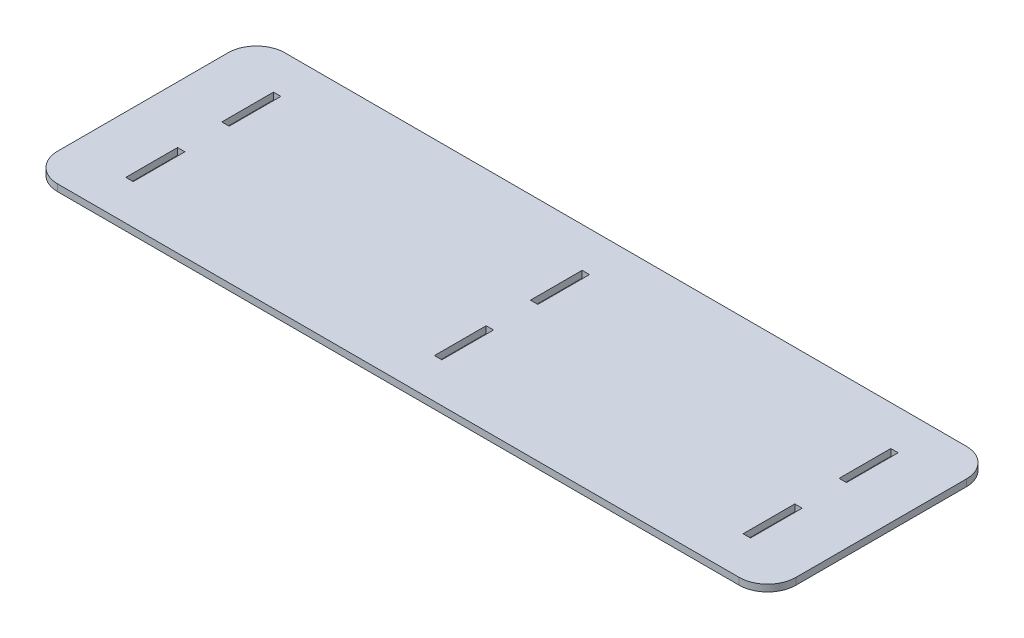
ISO-10303-21;
HEADER;
FILE_DESCRIPTION(('STEP AP214'),'2;1');
FILE_NAME('part.step','',(''),(''),'','','');
FILE_SCHEMA(('AUTOMOTIVE_DESIGN { 1 0 10303 214 1 1 1 1 }'));
ENDSEC;
DATA;
#1=APPLICATION_CONTEXT('core data for automotive mechanical design processes');
#2=APPLICATION_PROTOCOL_DEFINITION('international standard','automotive_design',2000,#1);
#3=PRODUCT_CONTEXT('',#1,'mechanical');
#4=PRODUCT('Part','Part','',(#3));
#5=PRODUCT_RELATED_PRODUCT_CATEGORY('part','',(#4));
#6=PRODUCT_DEFINITION_FORMATION('','',#4);
#7=PRODUCT_DEFINITION_CONTEXT('part definition',#1,'design');
#8=PRODUCT_DEFINITION('design','',#6,#7);
#9=PRODUCT_DEFINITION_SHAPE('','',#8);
#10=(LENGTH_UNIT() NAMED_UNIT(*) SI_UNIT(.MILLI.,.METRE.));
#11=(NAMED_UNIT(*) PLANE_ANGLE_UNIT() SI_UNIT($,.RADIAN.));
#12=(NAMED_UNIT(*) SI_UNIT($,.STERADIAN.) SOLID_ANGLE_UNIT());
#13=UNCERTAINTY_MEASURE_WITH_UNIT(LENGTH_MEASURE(1.E-05),#10,'distance_accuracy_value','');
#14=(GEOMETRIC_REPRESENTATION_CONTEXT(3) GLOBAL_UNCERTAINTY_ASSIGNED_CONTEXT((#13)) GLOBAL_UNIT_ASSIGNED_CONTEXT((#10,
#11,#12)) REPRESENTATION_CONTEXT('',''));
#15=CARTESIAN_POINT('',(0.,0.,0.));
#16=DIRECTION('',(0.,0.,1.));
#17=DIRECTION('',(1.,0.,0.));
#18=AXIS2_PLACEMENT_3D('',#15,#16,#17);
#19=CARTESIAN_POINT('',(0.,12.,0.));
#20=DIRECTION('',(0.,1.,0.));
#21=DIRECTION('',(0.,0.,1.));
#22=AXIS2_PLACEMENT_3D('',#19,#20,#21);
#23=PLANE('',#22);
#24=DIRECTION('',(-1.,0.,0.));
#25=VECTOR('',#24,1.);
#26=CARTESIAN_POINT('',(-650.,12.,-200.));
#27=LINE('',#26,#25);
#28=CARTESIAN_POINT('',(600.,12.,-200.));
#29=VERTEX_POINT('',#28);
#30=CARTESIAN_POINT('',(-600.,12.,-200.));
#31=VERTEX_POINT('',#30);
#32=EDGE_CURVE('E446',#29,#31,#27,.T.);
#33=ORIENTED_EDGE('',*,*,#32,.T.);
#34=CARTESIAN_POINT('',(-600.,12.,-150.));
#35=DIRECTION('',(0.,1.,0.));
#36=DIRECTION('',(0.,0.,1.));
#37=AXIS2_PLACEMENT_3D('',#34,#35,#36);
#38=CIRCLE('',#37,50.);
#39=CARTESIAN_POINT('',(-650.,12.,-150.));
#40=VERTEX_POINT('',#39);
#41=EDGE_CURVE('E486',#31,#40,#38,.T.);
#42=ORIENTED_EDGE('',*,*,#41,.T.);
#43=DIRECTION('',(0.,0.,1.));
#44=VECTOR('',#43,1.);
#45=CARTESIAN_POINT('',(-650.,12.,-200.));
#46=LINE('',#45,#44);
#47=CARTESIAN_POINT('',(-650.,12.,150.));
#48=VERTEX_POINT('',#47);
#49=EDGE_CURVE('E450',#40,#48,#46,.T.);
#50=ORIENTED_EDGE('',*,*,#49,.T.);
#51=CARTESIAN_POINT('',(-600.,12.,150.));
#52=DIRECTION('',(0.,1.,0.));
#53=DIRECTION('',(0.,0.,1.));
#54=AXIS2_PLACEMENT_3D('',#51,#52,#53);
#55=CIRCLE('',#54,50.);
#56=CARTESIAN_POINT('',(-600.,12.,200.));
#57=VERTEX_POINT('',#56);
#58=EDGE_CURVE('E57',#48,#57,#55,.T.);
#59=ORIENTED_EDGE('',*,*,#58,.T.);
#60=DIRECTION('',(1.,0.,0.));
#61=VECTOR('',#60,1.);
#62=CARTESIAN_POINT('',(-650.,12.,200.));
#63=LINE('',#62,#61);
#64=CARTESIAN_POINT('',(600.,12.,200.));
#65=VERTEX_POINT('',#64);
#66=EDGE_CURVE('E452',#57,#65,#63,.T.);
#67=ORIENTED_EDGE('',*,*,#66,.T.);
#68=CARTESIAN_POINT('',(600.,12.,150.));
#69=DIRECTION('',(0.,1.,0.));
#70=DIRECTION('',(0.,0.,1.));
#71=AXIS2_PLACEMENT_3D('',#68,#69,#70);
#72=CIRCLE('',#71,50.);
#73=CARTESIAN_POINT('',(650.,12.,150.));
#74=VERTEX_POINT('',#73);
#75=EDGE_CURVE('E483',#65,#74,#72,.T.);
#76=ORIENTED_EDGE('',*,*,#75,.T.);
#77=DIRECTION('',(0.,0.,-1.));
#78=VECTOR('',#77,1.);
#79=CARTESIAN_POINT('',(650.,12.,-200.));
#80=LINE('',#79,#78);
#81=CARTESIAN_POINT('',(650.,12.,-150.));
#82=VERTEX_POINT('',#81);
#83=EDGE_CURVE('E443',#74,#82,#80,.T.);
#84=ORIENTED_EDGE('',*,*,#83,.T.);
#85=CARTESIAN_POINT('',(600.,12.,-150.));
#86=DIRECTION('',(0.,1.,0.));
#87=DIRECTION('',(0.,0.,1.));
#88=AXIS2_PLACEMENT_3D('',#85,#86,#87);
#89=CIRCLE('',#88,50.);
#90=EDGE_CURVE('E481',#82,#29,#89,.T.);
#91=ORIENTED_EDGE('',*,*,#90,.T.);
#92=EDGE_LOOP('',(#33,#42,#50,#59,#67,#76,#84,#91));
#93=FACE_BOUND('',#92,.T.);
#94=DIRECTION('',(0.,0.,-1.));
#95=VECTOR('',#94,1.);
#96=CARTESIAN_POINT('',(-537.,12.,38.9999999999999));
#97=LINE('',#96,#95);
#98=CARTESIAN_POINT('',(-537.,12.,130.));
#99=VERTEX_POINT('',#98);
#100=CARTESIAN_POINT('',(-537.,12.,38.9999999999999));
#101=VERTEX_POINT('',#100);
#102=EDGE_CURVE('E414',#99,#101,#97,.T.);
#103=ORIENTED_EDGE('',*,*,#102,.F.);
#104=DIRECTION('',(1.,0.,0.));
#105=VECTOR('',#104,1.);
#106=CARTESIAN_POINT('',(-537.,12.,130.));
#107=LINE('',#106,#105);
#108=CARTESIAN_POINT('',(-550.,12.,130.));
#109=VERTEX_POINT('',#108);
#110=EDGE_CURVE('E412',#109,#99,#107,.T.);
#111=ORIENTED_EDGE('',*,*,#110,.F.);
#112=DIRECTION('',(0.,0.,1.));
#113=VECTOR('',#112,1.);
#114=CARTESIAN_POINT('',(-550.,12.,130.));
#115=LINE('',#114,#113);
#116=CARTESIAN_POINT('',(-550.,12.,38.9999999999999));
#117=VERTEX_POINT('',#116);
#118=EDGE_CURVE('E420',#117,#109,#115,.T.);
#119=ORIENTED_EDGE('',*,*,#118,.F.);
#120=DIRECTION('',(-1.,0.,0.));
#121=VECTOR('',#120,1.);
#122=CARTESIAN_POINT('',(-550.,12.,38.9999999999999));
#123=LINE('',#122,#121);
#124=EDGE_CURVE('E417',#101,#117,#123,.T.);
#125=ORIENTED_EDGE('',*,*,#124,.F.);
#126=EDGE_LOOP('',(#103,#111,#119,#125));
#127=FACE_BOUND('',#126,.T.);
#128=DIRECTION('',(1.,0.,0.));
#129=VECTOR('',#128,1.);
#130=CARTESIAN_POINT('',(-537.,12.,-39.0000000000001));
#131=LINE('',#130,#129);
#132=CARTESIAN_POINT('',(-550.,12.,-39.0000000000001));
#133=VERTEX_POINT('',#132);
#134=CARTESIAN_POINT('',(-537.,12.,-39.0000000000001));
#135=VERTEX_POINT('',#134);
#136=EDGE_CURVE('E383',#133,#135,#131,.T.);
#137=ORIENTED_EDGE('',*,*,#136,.F.);
#138=DIRECTION('',(0.,0.,1.));
#139=VECTOR('',#138,1.);
#140=CARTESIAN_POINT('',(-550.,12.,-39.0000000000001));
#141=LINE('',#140,#139);
#142=CARTESIAN_POINT('',(-550.,12.,-130.));
#143=VERTEX_POINT('',#142);
#144=EDGE_CURVE('E381',#143,#133,#141,.T.);
#145=ORIENTED_EDGE('',*,*,#144,.F.);
#146=DIRECTION('',(-1.,0.,0.));
#147=VECTOR('',#146,1.);
#148=CARTESIAN_POINT('',(-550.,12.,-130.));
#149=LINE('',#148,#147);
#150=CARTESIAN_POINT('',(-537.,12.,-130.));
#151=VERTEX_POINT('',#150);
#152=EDGE_CURVE('E389',#151,#143,#149,.T.);
#153=ORIENTED_EDGE('',*,*,#152,.F.);
#154=DIRECTION('',(0.,0.,-1.));
#155=VECTOR('',#154,1.);
#156=CARTESIAN_POINT('',(-537.,12.,-130.));
#157=LINE('',#156,#155);
#158=EDGE_CURVE('E386',#135,#151,#157,.T.);
#159=ORIENTED_EDGE('',*,*,#158,.F.);
#160=EDGE_LOOP('',(#137,#145,#153,#159));
#161=FACE_BOUND('',#160,.T.);
#162=DIRECTION('',(1.,0.,0.));
#163=VECTOR('',#162,1.);
#164=CARTESIAN_POINT('',(537.,12.,130.));
#165=LINE('',#164,#163);
#166=CARTESIAN_POINT('',(537.,12.,130.));
#167=VERTEX_POINT('',#166);
#168=CARTESIAN_POINT('',(550.,12.,130.));
#169=VERTEX_POINT('',#168);
#170=EDGE_CURVE('E352',#167,#169,#165,.T.);
#171=ORIENTED_EDGE('',*,*,#170,.F.);
#172=DIRECTION('',(0.,0.,1.));
#173=VECTOR('',#172,1.);
#174=CARTESIAN_POINT('',(537.,12.,38.9999999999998));
#175=LINE('',#174,#173);
#176=CARTESIAN_POINT('',(537.,12.,38.9999999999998));
#177=VERTEX_POINT('',#176);
#178=EDGE_CURVE('E350',#177,#167,#175,.T.);
#179=ORIENTED_EDGE('',*,*,#178,.F.);
#180=DIRECTION('',(-1.,0.,0.));
#181=VECTOR('',#180,1.);
#182=CARTESIAN_POINT('',(550.,12.,38.9999999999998));
#183=LINE('',#182,#181);
#184=CARTESIAN_POINT('',(550.,12.,38.9999999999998));
#185=VERTEX_POINT('',#184);
#186=EDGE_CURVE('E358',#185,#177,#183,.T.);
#187=ORIENTED_EDGE('',*,*,#186,.F.);
#188=DIRECTION('',(0.,0.,-1.));
#189=VECTOR('',#188,1.);
#190=CARTESIAN_POINT('',(550.,12.,130.));
#191=LINE('',#190,#189);
#192=EDGE_CURVE('E355',#169,#185,#191,.T.);
#193=ORIENTED_EDGE('',*,*,#192,.F.);
#194=EDGE_LOOP('',(#171,#179,#187,#193));
#195=FACE_BOUND('',#194,.T.);
#196=DIRECTION('',(1.,0.,0.));
#197=VECTOR('',#196,1.);
#198=CARTESIAN_POINT('',(537.,12.,-39.0000000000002));
#199=LINE('',#198,#197);
#200=CARTESIAN_POINT('',(537.,12.,-39.0000000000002));
#201=VERTEX_POINT('',#200);
#202=CARTESIAN_POINT('',(550.,12.,-39.0000000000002));
#203=VERTEX_POINT('',#202);
#204=EDGE_CURVE('E321',#201,#203,#199,.T.);
#205=ORIENTED_EDGE('',*,*,#204,.F.);
#206=DIRECTION('',(0.,0.,1.));
#207=VECTOR('',#206,1.);
#208=CARTESIAN_POINT('',(537.,12.,-130.));
#209=LINE('',#208,#207);
#210=CARTESIAN_POINT('',(537.,12.,-130.));
#211=VERTEX_POINT('',#210);
#212=EDGE_CURVE('E319',#211,#201,#209,.T.);
#213=ORIENTED_EDGE('',*,*,#212,.F.);
#214=DIRECTION('',(-1.,0.,0.));
#215=VECTOR('',#214,1.);
#216=CARTESIAN_POINT('',(550.,12.,-130.));
#217=LINE('',#216,#215);
#218=CARTESIAN_POINT('',(550.,12.,-130.));
#219=VERTEX_POINT('',#218);
#220=EDGE_CURVE('E327',#219,#211,#217,.T.);
#221=ORIENTED_EDGE('',*,*,#220,.F.);
#222=DIRECTION('',(0.,0.,-1.));
#223=VECTOR('',#222,1.);
#224=CARTESIAN_POINT('',(550.,12.,-39.0000000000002));
#225=LINE('',#224,#223);
#226=EDGE_CURVE('E324',#203,#219,#225,.T.);
#227=ORIENTED_EDGE('',*,*,#226,.F.);
#228=EDGE_LOOP('',(#205,#213,#221,#227));
#229=FACE_BOUND('',#228,.T.);
#230=DIRECTION('',(1.,0.,0.));
#231=VECTOR('',#230,1.);
#232=CARTESIAN_POINT('',(6.50000000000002,12.,-39.0000000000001));
#233=LINE('',#232,#231);
#234=CARTESIAN_POINT('',(-6.49999999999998,12.,-39.0000000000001));
#235=VERTEX_POINT('',#234);
#236=CARTESIAN_POINT('',(6.50000000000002,12.,-39.0000000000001));
#237=VERTEX_POINT('',#236);
#238=EDGE_CURVE('E290',#235,#237,#233,.T.);
#239=ORIENTED_EDGE('',*,*,#238,.F.);
#240=DIRECTION('',(0.,0.,1.));
#241=VECTOR('',#240,1.);
#242=CARTESIAN_POINT('',(-6.49999999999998,12.,-39.0000000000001));
#243=LINE('',#242,#241);
#244=CARTESIAN_POINT('',(-6.49999999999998,12.,-130.));
#245=VERTEX_POINT('',#244);
#246=EDGE_CURVE('E288',#245,#235,#243,.T.);
#247=ORIENTED_EDGE('',*,*,#246,.F.);
#248=DIRECTION('',(-1.,0.,0.));
#249=VECTOR('',#248,1.);
#250=CARTESIAN_POINT('',(-6.49999999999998,12.,-130.));
#251=LINE('',#250,#249);
#252=CARTESIAN_POINT('',(6.50000000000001,12.,-130.));
#253=VERTEX_POINT('',#252);
#254=EDGE_CURVE('E296',#253,#245,#251,.T.);
#255=ORIENTED_EDGE('',*,*,#254,.F.);
#256=DIRECTION('',(0.,0.,-1.));
#257=VECTOR('',#256,1.);
#258=CARTESIAN_POINT('',(6.50000000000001,12.,-130.));
#259=LINE('',#258,#257);
#260=EDGE_CURVE('E293',#237,#253,#259,.T.);
#261=ORIENTED_EDGE('',*,*,#260,.F.);
#262=EDGE_LOOP('',(#239,#247,#255,#261));
#263=FACE_BOUND('',#262,.T.);
#264=DIRECTION('',(-1.,0.,0.));
#265=VECTOR('',#264,1.);
#266=CARTESIAN_POINT('',(6.50000000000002,12.,39.0000000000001));
#267=LINE('',#266,#265);
#268=CARTESIAN_POINT('',(6.50000000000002,12.,39.0000000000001));
#269=VERTEX_POINT('',#268);
#270=CARTESIAN_POINT('',(-6.49999999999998,12.,39.0000000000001));
#271=VERTEX_POINT('',#270);
#272=EDGE_CURVE('E257',#269,#271,#267,.T.);
#273=ORIENTED_EDGE('',*,*,#272,.F.);
#274=DIRECTION('',(0.,0.,-1.));
#275=VECTOR('',#274,1.);
#276=CARTESIAN_POINT('',(6.50000000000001,12.,130.));
#277=LINE('',#276,#275);
#278=CARTESIAN_POINT('',(6.50000000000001,12.,130.));
#279=VERTEX_POINT('',#278);
#280=EDGE_CURVE('E247',#279,#269,#277,.T.);
#281=ORIENTED_EDGE('',*,*,#280,.F.);
#282=DIRECTION('',(1.,0.,0.));
#283=VECTOR('',#282,1.);
#284=CARTESIAN_POINT('',(-6.49999999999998,12.,130.));
#285=LINE('',#284,#283);
#286=CARTESIAN_POINT('',(-6.49999999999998,12.,130.));
#287=VERTEX_POINT('',#286);
#288=EDGE_CURVE('E272',#287,#279,#285,.T.);
#289=ORIENTED_EDGE('',*,*,#288,.F.);
#290=DIRECTION('',(0.,0.,1.));
#291=VECTOR('',#290,1.);
#292=CARTESIAN_POINT('',(-6.49999999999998,12.,39.0000000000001));
#293=LINE('',#292,#291);
#294=EDGE_CURVE('E270',#271,#287,#293,.T.);
#295=ORIENTED_EDGE('',*,*,#294,.F.);
#296=EDGE_LOOP('',(#273,#281,#289,#295));
#297=FACE_BOUND('',#296,.T.);
#298=ADVANCED_FACE('F35',(#93,#127,#161,#195,#229,#263,#297),#23,.T.);
#299=CARTESIAN_POINT('',(0.,0.,0.));
#300=DIRECTION('',(0.,1.,0.));
#301=DIRECTION('',(0.,0.,1.));
#302=AXIS2_PLACEMENT_3D('',#299,#300,#301);
#303=PLANE('',#302);
#304=DIRECTION('',(0.,0.,1.));
#305=VECTOR('',#304,1.);
#306=CARTESIAN_POINT('',(-6.49999999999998,0.,-39.0000000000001));
#307=LINE('',#306,#305);
#308=CARTESIAN_POINT('',(-6.49999999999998,0.,-130.));
#309=VERTEX_POINT('',#308);
#310=CARTESIAN_POINT('',(-6.49999999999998,0.,-39.0000000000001));
#311=VERTEX_POINT('',#310);
#312=EDGE_CURVE('E265',#309,#311,#307,.T.);
#313=ORIENTED_EDGE('',*,*,#312,.T.);
#314=DIRECTION('',(1.,0.,0.));
#315=VECTOR('',#314,1.);
#316=CARTESIAN_POINT('',(6.50000000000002,0.,-39.0000000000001));
#317=LINE('',#316,#315);
#318=CARTESIAN_POINT('',(6.50000000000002,0.,-39.0000000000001));
#319=VERTEX_POINT('',#318);
#320=EDGE_CURVE('E301',#311,#319,#317,.T.);
#321=ORIENTED_EDGE('',*,*,#320,.T.);
#322=DIRECTION('',(0.,0.,-1.));
#323=VECTOR('',#322,1.);
#324=CARTESIAN_POINT('',(6.50000000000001,0.,-130.));
#325=LINE('',#324,#323);
#326=CARTESIAN_POINT('',(6.50000000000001,0.,-130.));
#327=VERTEX_POINT('',#326);
#328=EDGE_CURVE('E304',#319,#327,#325,.T.);
#329=ORIENTED_EDGE('',*,*,#328,.T.);
#330=DIRECTION('',(-1.,0.,0.));
#331=VECTOR('',#330,1.);
#332=CARTESIAN_POINT('',(-6.49999999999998,0.,-130.));
#333=LINE('',#332,#331);
#334=EDGE_CURVE('E291',#327,#309,#333,.T.);
#335=ORIENTED_EDGE('',*,*,#334,.T.);
#336=EDGE_LOOP('',(#313,#321,#329,#335));
#337=FACE_BOUND('',#336,.T.);
#338=DIRECTION('',(0.,0.,1.));
#339=VECTOR('',#338,1.);
#340=CARTESIAN_POINT('',(537.,0.,38.9999999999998));
#341=LINE('',#340,#339);
#342=CARTESIAN_POINT('',(537.,0.,38.9999999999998));
#343=VERTEX_POINT('',#342);
#344=CARTESIAN_POINT('',(537.,0.,130.));
#345=VERTEX_POINT('',#344);
#346=EDGE_CURVE('E349',#343,#345,#341,.T.);
#347=ORIENTED_EDGE('',*,*,#346,.T.);
#348=DIRECTION('',(1.,0.,0.));
#349=VECTOR('',#348,1.);
#350=CARTESIAN_POINT('',(537.,0.,130.));
#351=LINE('',#350,#349);
#352=CARTESIAN_POINT('',(550.,0.,130.));
#353=VERTEX_POINT('',#352);
#354=EDGE_CURVE('E363',#345,#353,#351,.T.);
#355=ORIENTED_EDGE('',*,*,#354,.T.);
#356=DIRECTION('',(0.,0.,-1.));
#357=VECTOR('',#356,1.);
#358=CARTESIAN_POINT('',(550.,0.,130.));
#359=LINE('',#358,#357);
#360=CARTESIAN_POINT('',(550.,0.,38.9999999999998));
#361=VERTEX_POINT('',#360);
#362=EDGE_CURVE('E366',#353,#361,#359,.T.);
#363=ORIENTED_EDGE('',*,*,#362,.T.);
#364=DIRECTION('',(-1.,0.,0.));
#365=VECTOR('',#364,1.);
#366=CARTESIAN_POINT('',(550.,0.,38.9999999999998));
#367=LINE('',#366,#365);
#368=EDGE_CURVE('E353',#361,#343,#367,.T.);
#369=ORIENTED_EDGE('',*,*,#368,.T.);
#370=EDGE_LOOP('',(#347,#355,#363,#369));
#371=FACE_BOUND('',#370,.T.);
#372=DIRECTION('',(1.,0.,0.));
#373=VECTOR('',#372,1.);
#374=CARTESIAN_POINT('',(-537.,0.,130.));
#375=LINE('',#374,#373);
#376=CARTESIAN_POINT('',(-550.,0.,130.));
#377=VERTEX_POINT('',#376);
#378=CARTESIAN_POINT('',(-537.,0.,130.));
#379=VERTEX_POINT('',#378);
#380=EDGE_CURVE('E411',#377,#379,#375,.T.);
#381=ORIENTED_EDGE('',*,*,#380,.T.);
#382=DIRECTION('',(0.,0.,-1.));
#383=VECTOR('',#382,1.);
#384=CARTESIAN_POINT('',(-537.,0.,38.9999999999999));
#385=LINE('',#384,#383);
#386=CARTESIAN_POINT('',(-537.,0.,38.9999999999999));
#387=VERTEX_POINT('',#386);
#388=EDGE_CURVE('E425',#379,#387,#385,.T.);
#389=ORIENTED_EDGE('',*,*,#388,.T.);
#390=DIRECTION('',(-1.,0.,0.));
#391=VECTOR('',#390,1.);
#392=CARTESIAN_POINT('',(-550.,0.,38.9999999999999));
#393=LINE('',#392,#391);
#394=CARTESIAN_POINT('',(-550.,0.,38.9999999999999));
#395=VERTEX_POINT('',#394);
#396=EDGE_CURVE('E428',#387,#395,#393,.T.);
#397=ORIENTED_EDGE('',*,*,#396,.T.);
#398=DIRECTION('',(0.,0.,1.));
#399=VECTOR('',#398,1.);
#400=CARTESIAN_POINT('',(-550.,0.,130.));
#401=LINE('',#400,#399);
#402=EDGE_CURVE('E415',#395,#377,#401,.T.);
#403=ORIENTED_EDGE('',*,*,#402,.T.);
#404=EDGE_LOOP('',(#381,#389,#397,#403));
#405=FACE_BOUND('',#404,.T.);
#406=DIRECTION('',(0.,0.,1.));
#407=VECTOR('',#406,1.);
#408=CARTESIAN_POINT('',(-650.,0.,-200.));
#409=LINE('',#408,#407);
#410=CARTESIAN_POINT('',(-650.,0.,-150.));
#411=VERTEX_POINT('',#410);
#412=CARTESIAN_POINT('',(-650.,0.,150.));
#413=VERTEX_POINT('',#412);
#414=EDGE_CURVE('E460',#411,#413,#409,.T.);
#415=ORIENTED_EDGE('',*,*,#414,.F.);
#416=CARTESIAN_POINT('',(-600.,0.,-150.));
#417=DIRECTION('',(0.,1.,0.));
#418=DIRECTION('',(0.,0.,1.));
#419=AXIS2_PLACEMENT_3D('',#416,#417,#418);
#420=CIRCLE('',#419,50.);
#421=CARTESIAN_POINT('',(-600.,0.,-200.));
#422=VERTEX_POINT('',#421);
#423=EDGE_CURVE('E474',#411,#422,#420,.F.);
#424=ORIENTED_EDGE('',*,*,#423,.T.);
#425=DIRECTION('',(-1.,0.,0.));
#426=VECTOR('',#425,1.);
#427=CARTESIAN_POINT('',(-650.,0.,-200.));
#428=LINE('',#427,#426);
#429=CARTESIAN_POINT('',(600.,0.,-200.));
#430=VERTEX_POINT('',#429);
#431=EDGE_CURVE('E457',#430,#422,#428,.T.);
#432=ORIENTED_EDGE('',*,*,#431,.F.);
#433=CARTESIAN_POINT('',(600.,0.,-150.));
#434=DIRECTION('',(0.,1.,0.));
#435=DIRECTION('',(0.,0.,1.));
#436=AXIS2_PLACEMENT_3D('',#433,#434,#435);
#437=CIRCLE('',#436,50.);
#438=CARTESIAN_POINT('',(650.,0.,-150.));
#439=VERTEX_POINT('',#438);
#440=EDGE_CURVE('E468',#430,#439,#437,.F.);
#441=ORIENTED_EDGE('',*,*,#440,.T.);
#442=DIRECTION('',(0.,0.,-1.));
#443=VECTOR('',#442,1.);
#444=CARTESIAN_POINT('',(650.,0.,-200.));
#445=LINE('',#444,#443);
#446=CARTESIAN_POINT('',(650.,0.,150.));
#447=VERTEX_POINT('',#446);
#448=EDGE_CURVE('E442',#447,#439,#445,.T.);
#449=ORIENTED_EDGE('',*,*,#448,.F.);
#450=CARTESIAN_POINT('',(600.,0.,150.));
#451=DIRECTION('',(0.,1.,0.));
#452=DIRECTION('',(0.,0.,1.));
#453=AXIS2_PLACEMENT_3D('',#450,#451,#452);
#454=CIRCLE('',#453,50.);
#455=CARTESIAN_POINT('',(600.,0.,200.));
#456=VERTEX_POINT('',#455);
#457=EDGE_CURVE('E470',#447,#456,#454,.F.);
#458=ORIENTED_EDGE('',*,*,#457,.T.);
#459=DIRECTION('',(1.,0.,0.));
#460=VECTOR('',#459,1.);
#461=CARTESIAN_POINT('',(-650.,0.,200.));
#462=LINE('',#461,#460);
#463=CARTESIAN_POINT('',(-600.,0.,200.));
#464=VERTEX_POINT('',#463);
#465=EDGE_CURVE('E447',#464,#456,#462,.T.);
#466=ORIENTED_EDGE('',*,*,#465,.F.);
#467=CARTESIAN_POINT('',(-600.,0.,150.));
#468=DIRECTION('',(0.,1.,0.));
#469=DIRECTION('',(0.,0.,1.));
#470=AXIS2_PLACEMENT_3D('',#467,#468,#469);
#471=CIRCLE('',#470,50.);
#472=EDGE_CURVE('E472',#464,#413,#471,.F.);
#473=ORIENTED_EDGE('',*,*,#472,.T.);
#474=EDGE_LOOP('',(#415,#424,#432,#441,#449,#458,#466,#473));
#475=FACE_BOUND('',#474,.T.);
#476=DIRECTION('',(0.,0.,1.));
#477=VECTOR('',#476,1.);
#478=CARTESIAN_POINT('',(-550.,0.,-39.0000000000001));
#479=LINE('',#478,#477);
#480=CARTESIAN_POINT('',(-550.,0.,-130.));
#481=VERTEX_POINT('',#480);
#482=CARTESIAN_POINT('',(-550.,0.,-39.0000000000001));
#483=VERTEX_POINT('',#482);
#484=EDGE_CURVE('E380',#481,#483,#479,.T.);
#485=ORIENTED_EDGE('',*,*,#484,.T.);
#486=DIRECTION('',(1.,0.,0.));
#487=VECTOR('',#486,1.);
#488=CARTESIAN_POINT('',(-537.,0.,-39.0000000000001));
#489=LINE('',#488,#487);
#490=CARTESIAN_POINT('',(-537.,0.,-39.0000000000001));
#491=VERTEX_POINT('',#490);
#492=EDGE_CURVE('E394',#483,#491,#489,.T.);
#493=ORIENTED_EDGE('',*,*,#492,.T.);
#494=DIRECTION('',(0.,0.,-1.));
#495=VECTOR('',#494,1.);
#496=CARTESIAN_POINT('',(-537.,0.,-130.));
#497=LINE('',#496,#495);
#498=CARTESIAN_POINT('',(-537.,0.,-130.));
#499=VERTEX_POINT('',#498);
#500=EDGE_CURVE('E397',#491,#499,#497,.T.);
#501=ORIENTED_EDGE('',*,*,#500,.T.);
#502=DIRECTION('',(-1.,0.,0.));
#503=VECTOR('',#502,1.);
#504=CARTESIAN_POINT('',(-550.,0.,-130.));
#505=LINE('',#504,#503);
#506=EDGE_CURVE('E384',#499,#481,#505,.T.);
#507=ORIENTED_EDGE('',*,*,#506,.T.);
#508=EDGE_LOOP('',(#485,#493,#501,#507));
#509=FACE_BOUND('',#508,.T.);
#510=DIRECTION('',(0.,0.,1.));
#511=VECTOR('',#510,1.);
#512=CARTESIAN_POINT('',(537.,0.,-130.));
#513=LINE('',#512,#511);
#514=CARTESIAN_POINT('',(537.,0.,-130.));
#515=VERTEX_POINT('',#514);
#516=CARTESIAN_POINT('',(537.,0.,-39.0000000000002));
#517=VERTEX_POINT('',#516);
#518=EDGE_CURVE('E318',#515,#517,#513,.T.);
#519=ORIENTED_EDGE('',*,*,#518,.T.);
#520=DIRECTION('',(1.,0.,0.));
#521=VECTOR('',#520,1.);
#522=CARTESIAN_POINT('',(537.,0.,-39.0000000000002));
#523=LINE('',#522,#521);
#524=CARTESIAN_POINT('',(550.,0.,-39.0000000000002));
#525=VERTEX_POINT('',#524);
#526=EDGE_CURVE('E332',#517,#525,#523,.T.);
#527=ORIENTED_EDGE('',*,*,#526,.T.);
#528=DIRECTION('',(0.,0.,-1.));
#529=VECTOR('',#528,1.);
#530=CARTESIAN_POINT('',(550.,0.,-39.0000000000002));
#531=LINE('',#530,#529);
#532=CARTESIAN_POINT('',(550.,0.,-130.));
#533=VERTEX_POINT('',#532);
#534=EDGE_CURVE('E335',#525,#533,#531,.T.);
#535=ORIENTED_EDGE('',*,*,#534,.T.);
#536=DIRECTION('',(-1.,0.,0.));
#537=VECTOR('',#536,1.);
#538=CARTESIAN_POINT('',(550.,0.,-130.));
#539=LINE('',#538,#537);
#540=EDGE_CURVE('E322',#533,#515,#539,.T.);
#541=ORIENTED_EDGE('',*,*,#540,.T.);
#542=EDGE_LOOP('',(#519,#527,#535,#541));
#543=FACE_BOUND('',#542,.T.);
#544=DIRECTION('',(0.,0.,-1.));
#545=VECTOR('',#544,1.);
#546=CARTESIAN_POINT('',(6.50000000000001,0.,130.));
#547=LINE('',#546,#545);
#548=CARTESIAN_POINT('',(6.50000000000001,0.,130.));
#549=VERTEX_POINT('',#548);
#550=CARTESIAN_POINT('',(6.50000000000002,0.,39.0000000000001));
#551=VERTEX_POINT('',#550);
#552=EDGE_CURVE('E276',#549,#551,#547,.T.);
#553=ORIENTED_EDGE('',*,*,#552,.T.);
#554=DIRECTION('',(-1.,0.,0.));
#555=VECTOR('',#554,1.);
#556=CARTESIAN_POINT('',(6.50000000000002,0.,39.0000000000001));
#557=LINE('',#556,#555);
#558=CARTESIAN_POINT('',(-6.49999999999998,0.,39.0000000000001));
#559=VERTEX_POINT('',#558);
#560=EDGE_CURVE('E264',#551,#559,#557,.T.);
#561=ORIENTED_EDGE('',*,*,#560,.T.);
#562=DIRECTION('',(0.,0.,1.));
#563=VECTOR('',#562,1.);
#564=CARTESIAN_POINT('',(-6.49999999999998,0.,39.0000000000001));
#565=LINE('',#564,#563);
#566=CARTESIAN_POINT('',(-6.49999999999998,0.,130.));
#567=VERTEX_POINT('',#566);
#568=EDGE_CURVE('E279',#559,#567,#565,.T.);
#569=ORIENTED_EDGE('',*,*,#568,.T.);
#570=DIRECTION('',(1.,0.,0.));
#571=VECTOR('',#570,1.);
#572=CARTESIAN_POINT('',(-6.49999999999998,0.,130.));
#573=LINE('',#572,#571);
#574=EDGE_CURVE('E258',#567,#549,#573,.T.);
#575=ORIENTED_EDGE('',*,*,#574,.T.);
#576=EDGE_LOOP('',(#553,#561,#569,#575));
#577=FACE_BOUND('',#576,.T.);
#578=ADVANCED_FACE('F509',(#337,#371,#405,#475,#509,#543,#577),#303,.F.);
#579=CARTESIAN_POINT('',(650.,12.,-200.));
#580=DIRECTION('',(-1.,0.,0.));
#581=DIRECTION('',(0.,0.,1.));
#582=AXIS2_PLACEMENT_3D('',#579,#580,#581);
#583=PLANE('',#582);
#584=ORIENTED_EDGE('',*,*,#83,.F.);
#585=DIRECTION('',(0.,-1.,0.));
#586=VECTOR('',#585,1.);
#587=CARTESIAN_POINT('',(650.,12.,150.));
#588=LINE('',#587,#586);
#589=EDGE_CURVE('E11',#74,#447,#588,.T.);
#590=ORIENTED_EDGE('',*,*,#589,.T.);
#591=ORIENTED_EDGE('',*,*,#448,.T.);
#592=DIRECTION('',(0.,-1.,0.));
#593=VECTOR('',#592,1.);
#594=CARTESIAN_POINT('',(650.,12.,-150.));
#595=LINE('',#594,#593);
#596=EDGE_CURVE('E43',#439,#82,#595,.F.);
#597=ORIENTED_EDGE('',*,*,#596,.T.);
#598=EDGE_LOOP('',(#584,#590,#591,#597));
#599=FACE_BOUND('',#598,.T.);
#600=ADVANCED_FACE('F494',(#599),#583,.F.);
#601=CARTESIAN_POINT('',(-650.,12.,-200.));
#602=DIRECTION('',(0.,0.,1.));
#603=DIRECTION('',(1.,0.,0.));
#604=AXIS2_PLACEMENT_3D('',#601,#602,#603);
#605=PLANE('',#604);
#606=ORIENTED_EDGE('',*,*,#431,.T.);
#607=DIRECTION('',(0.,-1.,0.));
#608=VECTOR('',#607,1.);
#609=CARTESIAN_POINT('',(-600.,12.,-200.));
#610=LINE('',#609,#608);
#611=EDGE_CURVE('E479',#422,#31,#610,.F.);
#612=ORIENTED_EDGE('',*,*,#611,.T.);
#613=ORIENTED_EDGE('',*,*,#32,.F.);
#614=DIRECTION('',(0.,-1.,0.));
#615=VECTOR('',#614,1.);
#616=CARTESIAN_POINT('',(600.,12.,-200.));
#617=LINE('',#616,#615);
#618=EDGE_CURVE('E476',#29,#430,#617,.T.);
#619=ORIENTED_EDGE('',*,*,#618,.T.);
#620=EDGE_LOOP('',(#606,#612,#613,#619));
#621=FACE_BOUND('',#620,.T.);
#622=ADVANCED_FACE('F505',(#621),#605,.F.);
#623=CARTESIAN_POINT('',(-650.,12.,-200.));
#624=DIRECTION('',(1.,0.,0.));
#625=DIRECTION('',(0.,0.,-1.));
#626=AXIS2_PLACEMENT_3D('',#623,#624,#625);
#627=PLANE('',#626);
#628=ORIENTED_EDGE('',*,*,#49,.F.);
#629=DIRECTION('',(0.,-1.,0.));
#630=VECTOR('',#629,1.);
#631=CARTESIAN_POINT('',(-650.,12.,-150.));
#632=LINE('',#631,#630);
#633=EDGE_CURVE('E465',#40,#411,#632,.T.);
#634=ORIENTED_EDGE('',*,*,#633,.T.);
#635=ORIENTED_EDGE('',*,*,#414,.T.);
#636=DIRECTION('',(0.,-1.,0.));
#637=VECTOR('',#636,1.);
#638=CARTESIAN_POINT('',(-650.,12.,150.));
#639=LINE('',#638,#637);
#640=EDGE_CURVE('E454',#413,#48,#639,.F.);
#641=ORIENTED_EDGE('',*,*,#640,.T.);
#642=EDGE_LOOP('',(#628,#634,#635,#641));
#643=FACE_BOUND('',#642,.T.);
#644=ADVANCED_FACE('F517',(#643),#627,.F.);
#645=CARTESIAN_POINT('',(-650.,12.,200.));
#646=DIRECTION('',(0.,0.,-1.));
#647=DIRECTION('',(-1.,0.,0.));
#648=AXIS2_PLACEMENT_3D('',#645,#646,#647);
#649=PLANE('',#648);
#650=ORIENTED_EDGE('',*,*,#66,.F.);
#651=DIRECTION('',(0.,-1.,0.));
#652=VECTOR('',#651,1.);
#653=CARTESIAN_POINT('',(-600.,12.,200.));
#654=LINE('',#653,#652);
#655=EDGE_CURVE('E489',#57,#464,#654,.T.);
#656=ORIENTED_EDGE('',*,*,#655,.T.);
#657=ORIENTED_EDGE('',*,*,#465,.T.);
#658=DIRECTION('',(0.,-1.,0.));
#659=VECTOR('',#658,1.);
#660=CARTESIAN_POINT('',(600.,12.,200.));
#661=LINE('',#660,#659);
#662=EDGE_CURVE('E50',#456,#65,#661,.F.);
#663=ORIENTED_EDGE('',*,*,#662,.T.);
#664=EDGE_LOOP('',(#650,#656,#657,#663));
#665=FACE_BOUND('',#664,.T.);
#666=ADVANCED_FACE('F523',(#665),#649,.F.);
#667=CARTESIAN_POINT('',(-537.,12.,130.));
#668=DIRECTION('',(0.,0.,-1.));
#669=DIRECTION('',(-1.,0.,0.));
#670=AXIS2_PLACEMENT_3D('',#667,#668,#669);
#671=PLANE('',#670);
#672=ORIENTED_EDGE('',*,*,#380,.F.);
#673=DIRECTION('',(0.,-1.,0.));
#674=VECTOR('',#673,1.);
#675=CARTESIAN_POINT('',(-550.,12.,130.));
#676=LINE('',#675,#674);
#677=EDGE_CURVE('E422',#109,#377,#676,.T.);
#678=ORIENTED_EDGE('',*,*,#677,.F.);
#679=ORIENTED_EDGE('',*,*,#110,.T.);
#680=DIRECTION('',(0.,-1.,0.));
#681=VECTOR('',#680,1.);
#682=CARTESIAN_POINT('',(-537.,12.,130.));
#683=LINE('',#682,#681);
#684=EDGE_CURVE('E439',#99,#379,#683,.T.);
#685=ORIENTED_EDGE('',*,*,#684,.T.);
#686=EDGE_LOOP('',(#672,#678,#679,#685));
#687=FACE_BOUND('',#686,.T.);
#688=ADVANCED_FACE('F540',(#687),#671,.T.);
#689=CARTESIAN_POINT('',(-537.,12.,38.9999999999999));
#690=DIRECTION('',(-1.,0.,0.));
#691=DIRECTION('',(0.,0.,1.));
#692=AXIS2_PLACEMENT_3D('',#689,#690,#691);
#693=PLANE('',#692);
#694=ORIENTED_EDGE('',*,*,#388,.F.);
#695=ORIENTED_EDGE('',*,*,#684,.F.);
#696=ORIENTED_EDGE('',*,*,#102,.T.);
#697=DIRECTION('',(0.,-1.,0.));
#698=VECTOR('',#697,1.);
#699=CARTESIAN_POINT('',(-537.,12.,38.9999999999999));
#700=LINE('',#699,#698);
#701=EDGE_CURVE('E437',#101,#387,#700,.T.);
#702=ORIENTED_EDGE('',*,*,#701,.T.);
#703=EDGE_LOOP('',(#694,#695,#696,#702));
#704=FACE_BOUND('',#703,.T.);
#705=ADVANCED_FACE('F640',(#704),#693,.T.);
#706=CARTESIAN_POINT('',(-550.,12.,38.9999999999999));
#707=DIRECTION('',(0.,0.,1.));
#708=DIRECTION('',(1.,0.,0.));
#709=AXIS2_PLACEMENT_3D('',#706,#707,#708);
#710=PLANE('',#709);
#711=ORIENTED_EDGE('',*,*,#396,.F.);
#712=ORIENTED_EDGE('',*,*,#701,.F.);
#713=ORIENTED_EDGE('',*,*,#124,.T.);
#714=DIRECTION('',(0.,-1.,0.));
#715=VECTOR('',#714,1.);
#716=CARTESIAN_POINT('',(-550.,12.,38.9999999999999));
#717=LINE('',#716,#715);
#718=EDGE_CURVE('E435',#117,#395,#717,.T.);
#719=ORIENTED_EDGE('',*,*,#718,.T.);
#720=EDGE_LOOP('',(#711,#712,#713,#719));
#721=FACE_BOUND('',#720,.T.);
#722=ADVANCED_FACE('F637',(#721),#710,.T.);
#723=CARTESIAN_POINT('',(-550.,12.,130.));
#724=DIRECTION('',(1.,0.,0.));
#725=DIRECTION('',(0.,0.,-1.));
#726=AXIS2_PLACEMENT_3D('',#723,#724,#725);
#727=PLANE('',#726);
#728=ORIENTED_EDGE('',*,*,#402,.F.);
#729=ORIENTED_EDGE('',*,*,#718,.F.);
#730=ORIENTED_EDGE('',*,*,#118,.T.);
#731=ORIENTED_EDGE('',*,*,#677,.T.);
#732=EDGE_LOOP('',(#728,#729,#730,#731));
#733=FACE_BOUND('',#732,.T.);
#734=ADVANCED_FACE('F633',(#733),#727,.T.);
#735=CARTESIAN_POINT('',(-550.,12.,-39.0000000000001));
#736=DIRECTION('',(1.,0.,0.));
#737=DIRECTION('',(0.,0.,-1.));
#738=AXIS2_PLACEMENT_3D('',#735,#736,#737);
#739=PLANE('',#738);
#740=ORIENTED_EDGE('',*,*,#484,.F.);
#741=DIRECTION('',(0.,-1.,0.));
#742=VECTOR('',#741,1.);
#743=CARTESIAN_POINT('',(-550.,12.,-130.));
#744=LINE('',#743,#742);
#745=EDGE_CURVE('E391',#143,#481,#744,.T.);
#746=ORIENTED_EDGE('',*,*,#745,.F.);
#747=ORIENTED_EDGE('',*,*,#144,.T.);
#748=DIRECTION('',(0.,-1.,0.));
#749=VECTOR('',#748,1.);
#750=CARTESIAN_POINT('',(-550.,12.,-39.0000000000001));
#751=LINE('',#750,#749);
#752=EDGE_CURVE('E408',#133,#483,#751,.T.);
#753=ORIENTED_EDGE('',*,*,#752,.T.);
#754=EDGE_LOOP('',(#740,#746,#747,#753));
#755=FACE_BOUND('',#754,.T.);
#756=ADVANCED_FACE('F629',(#755),#739,.T.);
#757=CARTESIAN_POINT('',(-537.,12.,-39.0000000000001));
#758=DIRECTION('',(0.,0.,-1.));
#759=DIRECTION('',(-1.,0.,0.));
#760=AXIS2_PLACEMENT_3D('',#757,#758,#759);
#761=PLANE('',#760);
#762=ORIENTED_EDGE('',*,*,#492,.F.);
#763=ORIENTED_EDGE('',*,*,#752,.F.);
#764=ORIENTED_EDGE('',*,*,#136,.T.);
#765=DIRECTION('',(0.,-1.,0.));
#766=VECTOR('',#765,1.);
#767=CARTESIAN_POINT('',(-537.,12.,-39.0000000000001));
#768=LINE('',#767,#766);
#769=EDGE_CURVE('E406',#135,#491,#768,.T.);
#770=ORIENTED_EDGE('',*,*,#769,.T.);
#771=EDGE_LOOP('',(#762,#763,#764,#770));
#772=FACE_BOUND('',#771,.T.);
#773=ADVANCED_FACE('F625',(#772),#761,.T.);
#774=CARTESIAN_POINT('',(-537.,12.,-130.));
#775=DIRECTION('',(-1.,0.,0.));
#776=DIRECTION('',(0.,0.,1.));
#777=AXIS2_PLACEMENT_3D('',#774,#775,#776);
#778=PLANE('',#777);
#779=ORIENTED_EDGE('',*,*,#500,.F.);
#780=ORIENTED_EDGE('',*,*,#769,.F.);
#781=ORIENTED_EDGE('',*,*,#158,.T.);
#782=DIRECTION('',(0.,-1.,0.));
#783=VECTOR('',#782,1.);
#784=CARTESIAN_POINT('',(-537.,12.,-130.));
#785=LINE('',#784,#783);
#786=EDGE_CURVE('E404',#151,#499,#785,.T.);
#787=ORIENTED_EDGE('',*,*,#786,.T.);
#788=EDGE_LOOP('',(#779,#780,#781,#787));
#789=FACE_BOUND('',#788,.T.);
#790=ADVANCED_FACE('F621',(#789),#778,.T.);
#791=CARTESIAN_POINT('',(-550.,12.,-130.));
#792=DIRECTION('',(0.,0.,1.));
#793=DIRECTION('',(1.,0.,0.));
#794=AXIS2_PLACEMENT_3D('',#791,#792,#793);
#795=PLANE('',#794);
#796=ORIENTED_EDGE('',*,*,#506,.F.);
#797=ORIENTED_EDGE('',*,*,#786,.F.);
#798=ORIENTED_EDGE('',*,*,#152,.T.);
#799=ORIENTED_EDGE('',*,*,#745,.T.);
#800=EDGE_LOOP('',(#796,#797,#798,#799));
#801=FACE_BOUND('',#800,.T.);
#802=ADVANCED_FACE('F617',(#801),#795,.T.);
#803=CARTESIAN_POINT('',(537.,12.,38.9999999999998));
#804=DIRECTION('',(1.,0.,0.));
#805=DIRECTION('',(0.,0.,-1.));
#806=AXIS2_PLACEMENT_3D('',#803,#804,#805);
#807=PLANE('',#806);
#808=ORIENTED_EDGE('',*,*,#346,.F.);
#809=DIRECTION('',(0.,-1.,0.));
#810=VECTOR('',#809,1.);
#811=CARTESIAN_POINT('',(537.,12.,38.9999999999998));
#812=LINE('',#811,#810);
#813=EDGE_CURVE('E360',#177,#343,#812,.T.);
#814=ORIENTED_EDGE('',*,*,#813,.F.);
#815=ORIENTED_EDGE('',*,*,#178,.T.);
#816=DIRECTION('',(0.,-1.,0.));
#817=VECTOR('',#816,1.);
#818=CARTESIAN_POINT('',(537.,12.,130.));
#819=LINE('',#818,#817);
#820=EDGE_CURVE('E377',#167,#345,#819,.T.);
#821=ORIENTED_EDGE('',*,*,#820,.T.);
#822=EDGE_LOOP('',(#808,#814,#815,#821));
#823=FACE_BOUND('',#822,.T.);
#824=ADVANCED_FACE('F613',(#823),#807,.T.);
#825=CARTESIAN_POINT('',(537.,12.,130.));
#826=DIRECTION('',(0.,0.,-1.));
#827=DIRECTION('',(-1.,0.,0.));
#828=AXIS2_PLACEMENT_3D('',#825,#826,#827);
#829=PLANE('',#828);
#830=ORIENTED_EDGE('',*,*,#354,.F.);
#831=ORIENTED_EDGE('',*,*,#820,.F.);
#832=ORIENTED_EDGE('',*,*,#170,.T.);
#833=DIRECTION('',(0.,-1.,0.));
#834=VECTOR('',#833,1.);
#835=CARTESIAN_POINT('',(550.,12.,130.));
#836=LINE('',#835,#834);
#837=EDGE_CURVE('E375',#169,#353,#836,.T.);
#838=ORIENTED_EDGE('',*,*,#837,.T.);
#839=EDGE_LOOP('',(#830,#831,#832,#838));
#840=FACE_BOUND('',#839,.T.);
#841=ADVANCED_FACE('F609',(#840),#829,.T.);
#842=CARTESIAN_POINT('',(550.,12.,130.));
#843=DIRECTION('',(-1.,0.,0.));
#844=DIRECTION('',(0.,0.,1.));
#845=AXIS2_PLACEMENT_3D('',#842,#843,#844);
#846=PLANE('',#845);
#847=ORIENTED_EDGE('',*,*,#362,.F.);
#848=ORIENTED_EDGE('',*,*,#837,.F.);
#849=ORIENTED_EDGE('',*,*,#192,.T.);
#850=DIRECTION('',(0.,-1.,0.));
#851=VECTOR('',#850,1.);
#852=CARTESIAN_POINT('',(550.,12.,38.9999999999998));
#853=LINE('',#852,#851);
#854=EDGE_CURVE('E373',#185,#361,#853,.T.);
#855=ORIENTED_EDGE('',*,*,#854,.T.);
#856=EDGE_LOOP('',(#847,#848,#849,#855));
#857=FACE_BOUND('',#856,.T.);
#858=ADVANCED_FACE('F605',(#857),#846,.T.);
#859=CARTESIAN_POINT('',(550.,12.,38.9999999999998));
#860=DIRECTION('',(0.,0.,1.));
#861=DIRECTION('',(1.,0.,0.));
#862=AXIS2_PLACEMENT_3D('',#859,#860,#861);
#863=PLANE('',#862);
#864=ORIENTED_EDGE('',*,*,#368,.F.);
#865=ORIENTED_EDGE('',*,*,#854,.F.);
#866=ORIENTED_EDGE('',*,*,#186,.T.);
#867=ORIENTED_EDGE('',*,*,#813,.T.);
#868=EDGE_LOOP('',(#864,#865,#866,#867));
#869=FACE_BOUND('',#868,.T.);
#870=ADVANCED_FACE('F601',(#869),#863,.T.);
#871=CARTESIAN_POINT('',(537.,12.,-130.));
#872=DIRECTION('',(1.,0.,0.));
#873=DIRECTION('',(0.,0.,-1.));
#874=AXIS2_PLACEMENT_3D('',#871,#872,#873);
#875=PLANE('',#874);
#876=ORIENTED_EDGE('',*,*,#518,.F.);
#877=DIRECTION('',(0.,-1.,0.));
#878=VECTOR('',#877,1.);
#879=CARTESIAN_POINT('',(537.,12.,-130.));
#880=LINE('',#879,#878);
#881=EDGE_CURVE('E329',#211,#515,#880,.T.);
#882=ORIENTED_EDGE('',*,*,#881,.F.);
#883=ORIENTED_EDGE('',*,*,#212,.T.);
#884=DIRECTION('',(0.,-1.,0.));
#885=VECTOR('',#884,1.);
#886=CARTESIAN_POINT('',(537.,12.,-39.0000000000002));
#887=LINE('',#886,#885);
#888=EDGE_CURVE('E346',#201,#517,#887,.T.);
#889=ORIENTED_EDGE('',*,*,#888,.T.);
#890=EDGE_LOOP('',(#876,#882,#883,#889));
#891=FACE_BOUND('',#890,.T.);
#892=ADVANCED_FACE('F597',(#891),#875,.T.);
#893=CARTESIAN_POINT('',(537.,12.,-39.0000000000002));
#894=DIRECTION('',(0.,0.,-1.));
#895=DIRECTION('',(-1.,0.,0.));
#896=AXIS2_PLACEMENT_3D('',#893,#894,#895);
#897=PLANE('',#896);
#898=ORIENTED_EDGE('',*,*,#526,.F.);
#899=ORIENTED_EDGE('',*,*,#888,.F.);
#900=ORIENTED_EDGE('',*,*,#204,.T.);
#901=DIRECTION('',(0.,-1.,0.));
#902=VECTOR('',#901,1.);
#903=CARTESIAN_POINT('',(550.,12.,-39.0000000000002));
#904=LINE('',#903,#902);
#905=EDGE_CURVE('E344',#203,#525,#904,.T.);
#906=ORIENTED_EDGE('',*,*,#905,.T.);
#907=EDGE_LOOP('',(#898,#899,#900,#906));
#908=FACE_BOUND('',#907,.T.);
#909=ADVANCED_FACE('F593',(#908),#897,.T.);
#910=CARTESIAN_POINT('',(550.,12.,-39.0000000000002));
#911=DIRECTION('',(-1.,0.,0.));
#912=DIRECTION('',(0.,0.,1.));
#913=AXIS2_PLACEMENT_3D('',#910,#911,#912);
#914=PLANE('',#913);
#915=ORIENTED_EDGE('',*,*,#534,.F.);
#916=ORIENTED_EDGE('',*,*,#905,.F.);
#917=ORIENTED_EDGE('',*,*,#226,.T.);
#918=DIRECTION('',(0.,-1.,0.));
#919=VECTOR('',#918,1.);
#920=CARTESIAN_POINT('',(550.,12.,-130.));
#921=LINE('',#920,#919);
#922=EDGE_CURVE('E342',#219,#533,#921,.T.);
#923=ORIENTED_EDGE('',*,*,#922,.T.);
#924=EDGE_LOOP('',(#915,#916,#917,#923));
#925=FACE_BOUND('',#924,.T.);
#926=ADVANCED_FACE('F589',(#925),#914,.T.);
#927=CARTESIAN_POINT('',(550.,12.,-130.));
#928=DIRECTION('',(0.,0.,1.));
#929=DIRECTION('',(1.,0.,0.));
#930=AXIS2_PLACEMENT_3D('',#927,#928,#929);
#931=PLANE('',#930);
#932=ORIENTED_EDGE('',*,*,#540,.F.);
#933=ORIENTED_EDGE('',*,*,#922,.F.);
#934=ORIENTED_EDGE('',*,*,#220,.T.);
#935=ORIENTED_EDGE('',*,*,#881,.T.);
#936=EDGE_LOOP('',(#932,#933,#934,#935));
#937=FACE_BOUND('',#936,.T.);
#938=ADVANCED_FACE('F585',(#937),#931,.T.);
#939=CARTESIAN_POINT('',(-6.49999999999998,12.,-39.0000000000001));
#940=DIRECTION('',(1.,0.,0.));
#941=DIRECTION('',(0.,0.,-1.));
#942=AXIS2_PLACEMENT_3D('',#939,#940,#941);
#943=PLANE('',#942);
#944=ORIENTED_EDGE('',*,*,#312,.F.);
#945=DIRECTION('',(0.,-1.,0.));
#946=VECTOR('',#945,1.);
#947=CARTESIAN_POINT('',(-6.49999999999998,12.,-130.));
#948=LINE('',#947,#946);
#949=EDGE_CURVE('E298',#245,#309,#948,.T.);
#950=ORIENTED_EDGE('',*,*,#949,.F.);
#951=ORIENTED_EDGE('',*,*,#246,.T.);
#952=DIRECTION('',(0.,-1.,0.));
#953=VECTOR('',#952,1.);
#954=CARTESIAN_POINT('',(-6.49999999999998,12.,-39.0000000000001));
#955=LINE('',#954,#953);
#956=EDGE_CURVE('E315',#235,#311,#955,.T.);
#957=ORIENTED_EDGE('',*,*,#956,.T.);
#958=EDGE_LOOP('',(#944,#950,#951,#957));
#959=FACE_BOUND('',#958,.T.);
#960=ADVANCED_FACE('F581',(#959),#943,.T.);
#961=CARTESIAN_POINT('',(6.50000000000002,12.,-39.0000000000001));
#962=DIRECTION('',(0.,0.,-1.));
#963=DIRECTION('',(-1.,0.,0.));
#964=AXIS2_PLACEMENT_3D('',#961,#962,#963);
#965=PLANE('',#964);
#966=ORIENTED_EDGE('',*,*,#320,.F.);
#967=ORIENTED_EDGE('',*,*,#956,.F.);
#968=ORIENTED_EDGE('',*,*,#238,.T.);
#969=DIRECTION('',(0.,-1.,0.));
#970=VECTOR('',#969,1.);
#971=CARTESIAN_POINT('',(6.50000000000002,12.,-39.0000000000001));
#972=LINE('',#971,#970);
#973=EDGE_CURVE('E313',#237,#319,#972,.T.);
#974=ORIENTED_EDGE('',*,*,#973,.T.);
#975=EDGE_LOOP('',(#966,#967,#968,#974));
#976=FACE_BOUND('',#975,.T.);
#977=ADVANCED_FACE('F577',(#976),#965,.T.);
#978=CARTESIAN_POINT('',(6.50000000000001,12.,-130.));
#979=DIRECTION('',(-1.,0.,0.));
#980=DIRECTION('',(0.,0.,1.));
#981=AXIS2_PLACEMENT_3D('',#978,#979,#980);
#982=PLANE('',#981);
#983=ORIENTED_EDGE('',*,*,#328,.F.);
#984=ORIENTED_EDGE('',*,*,#973,.F.);
#985=ORIENTED_EDGE('',*,*,#260,.T.);
#986=DIRECTION('',(0.,-1.,0.));
#987=VECTOR('',#986,1.);
#988=CARTESIAN_POINT('',(6.50000000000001,12.,-130.));
#989=LINE('',#988,#987);
#990=EDGE_CURVE('E311',#253,#327,#989,.T.);
#991=ORIENTED_EDGE('',*,*,#990,.T.);
#992=EDGE_LOOP('',(#983,#984,#985,#991));
#993=FACE_BOUND('',#992,.T.);
#994=ADVANCED_FACE('F573',(#993),#982,.T.);
#995=CARTESIAN_POINT('',(-6.49999999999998,12.,-130.));
#996=DIRECTION('',(0.,0.,1.));
#997=DIRECTION('',(1.,0.,0.));
#998=AXIS2_PLACEMENT_3D('',#995,#996,#997);
#999=PLANE('',#998);
#1000=ORIENTED_EDGE('',*,*,#334,.F.);
#1001=ORIENTED_EDGE('',*,*,#990,.F.);
#1002=ORIENTED_EDGE('',*,*,#254,.T.);
#1003=ORIENTED_EDGE('',*,*,#949,.T.);
#1004=EDGE_LOOP('',(#1000,#1001,#1002,#1003));
#1005=FACE_BOUND('',#1004,.T.);
#1006=ADVANCED_FACE('F570',(#1005),#999,.T.);
#1007=CARTESIAN_POINT('',(6.50000000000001,12.,130.));
#1008=DIRECTION('',(-1.,0.,0.));
#1009=DIRECTION('',(0.,0.,1.));
#1010=AXIS2_PLACEMENT_3D('',#1007,#1008,#1009);
#1011=PLANE('',#1010);
#1012=ORIENTED_EDGE('',*,*,#552,.F.);
#1013=DIRECTION('',(0.,-1.,0.));
#1014=VECTOR('',#1013,1.);
#1015=CARTESIAN_POINT('',(6.50000000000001,12.,130.));
#1016=LINE('',#1015,#1014);
#1017=EDGE_CURVE('E253',#279,#549,#1016,.T.);
#1018=ORIENTED_EDGE('',*,*,#1017,.F.);
#1019=ORIENTED_EDGE('',*,*,#280,.T.);
#1020=DIRECTION('',(0.,-1.,0.));
#1021=VECTOR('',#1020,1.);
#1022=CARTESIAN_POINT('',(6.50000000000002,12.,39.0000000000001));
#1023=LINE('',#1022,#1021);
#1024=EDGE_CURVE('E250',#269,#551,#1023,.T.);
#1025=ORIENTED_EDGE('',*,*,#1024,.T.);
#1026=EDGE_LOOP('',(#1012,#1018,#1019,#1025));
#1027=FACE_BOUND('',#1026,.T.);
#1028=ADVANCED_FACE('F249',(#1027),#1011,.T.);
#1029=CARTESIAN_POINT('',(6.50000000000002,12.,39.0000000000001));
#1030=DIRECTION('',(0.,0.,1.));
#1031=DIRECTION('',(1.,0.,0.));
#1032=AXIS2_PLACEMENT_3D('',#1029,#1030,#1031);
#1033=PLANE('',#1032);
#1034=ORIENTED_EDGE('',*,*,#560,.F.);
#1035=ORIENTED_EDGE('',*,*,#1024,.F.);
#1036=ORIENTED_EDGE('',*,*,#272,.T.);
#1037=DIRECTION('',(0.,-1.,0.));
#1038=VECTOR('',#1037,1.);
#1039=CARTESIAN_POINT('',(-6.49999999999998,12.,39.0000000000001));
#1040=LINE('',#1039,#1038);
#1041=EDGE_CURVE('E266',#271,#559,#1040,.T.);
#1042=ORIENTED_EDGE('',*,*,#1041,.T.);
#1043=EDGE_LOOP('',(#1034,#1035,#1036,#1042));
#1044=FACE_BOUND('',#1043,.T.);
#1045=ADVANCED_FACE('F261',(#1044),#1033,.T.);
#1046=CARTESIAN_POINT('',(-6.49999999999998,12.,39.0000000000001));
#1047=DIRECTION('',(1.,0.,0.));
#1048=DIRECTION('',(0.,0.,-1.));
#1049=AXIS2_PLACEMENT_3D('',#1046,#1047,#1048);
#1050=PLANE('',#1049);
#1051=ORIENTED_EDGE('',*,*,#568,.F.);
#1052=ORIENTED_EDGE('',*,*,#1041,.F.);
#1053=ORIENTED_EDGE('',*,*,#294,.T.);
#1054=DIRECTION('',(0.,-1.,0.));
#1055=VECTOR('',#1054,1.);
#1056=CARTESIAN_POINT('',(-6.49999999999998,12.,130.));
#1057=LINE('',#1056,#1055);
#1058=EDGE_CURVE('E285',#287,#567,#1057,.T.);
#1059=ORIENTED_EDGE('',*,*,#1058,.T.);
#1060=EDGE_LOOP('',(#1051,#1052,#1053,#1059));
#1061=FACE_BOUND('',#1060,.T.);
#1062=ADVANCED_FACE('F556',(#1061),#1050,.T.);
#1063=CARTESIAN_POINT('',(-6.49999999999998,12.,130.));
#1064=DIRECTION('',(0.,0.,-1.));
#1065=DIRECTION('',(-1.,0.,0.));
#1066=AXIS2_PLACEMENT_3D('',#1063,#1064,#1065);
#1067=PLANE('',#1066);
#1068=ORIENTED_EDGE('',*,*,#574,.F.);
#1069=ORIENTED_EDGE('',*,*,#1058,.F.);
#1070=ORIENTED_EDGE('',*,*,#288,.T.);
#1071=ORIENTED_EDGE('',*,*,#1017,.T.);
#1072=EDGE_LOOP('',(#1068,#1069,#1070,#1071));
#1073=FACE_BOUND('',#1072,.T.);
#1074=ADVANCED_FACE('F552',(#1073),#1067,.T.);
#1075=CARTESIAN_POINT('',(-600.,12.,-150.));
#1076=DIRECTION('',(0.,-1.,0.));
#1077=DIRECTION('',(0.,0.,-1.));
#1078=AXIS2_PLACEMENT_3D('',#1075,#1076,#1077);
#1079=CYLINDRICAL_SURFACE('',#1078,50.);
#1080=ORIENTED_EDGE('',*,*,#41,.F.);
#1081=ORIENTED_EDGE('',*,*,#611,.F.);
#1082=ORIENTED_EDGE('',*,*,#423,.F.);
#1083=ORIENTED_EDGE('',*,*,#633,.F.);
#1084=EDGE_LOOP('',(#1080,#1081,#1082,#1083));
#1085=FACE_BOUND('',#1084,.T.);
#1086=ADVANCED_FACE('F514',(#1085),#1079,.T.);
#1087=CARTESIAN_POINT('',(-600.,12.,150.));
#1088=DIRECTION('',(0.,-1.,0.));
#1089=DIRECTION('',(0.,0.,-1.));
#1090=AXIS2_PLACEMENT_3D('',#1087,#1088,#1089);
#1091=CYLINDRICAL_SURFACE('',#1090,50.);
#1092=ORIENTED_EDGE('',*,*,#58,.F.);
#1093=ORIENTED_EDGE('',*,*,#640,.F.);
#1094=ORIENTED_EDGE('',*,*,#472,.F.);
#1095=ORIENTED_EDGE('',*,*,#655,.F.);
#1096=EDGE_LOOP('',(#1092,#1093,#1094,#1095));
#1097=FACE_BOUND('',#1096,.T.);
#1098=ADVANCED_FACE('F521',(#1097),#1091,.T.);
#1099=CARTESIAN_POINT('',(600.,12.,150.));
#1100=DIRECTION('',(0.,-1.,0.));
#1101=DIRECTION('',(0.,0.,-1.));
#1102=AXIS2_PLACEMENT_3D('',#1099,#1100,#1101);
#1103=CYLINDRICAL_SURFACE('',#1102,50.);
#1104=ORIENTED_EDGE('',*,*,#75,.F.);
#1105=ORIENTED_EDGE('',*,*,#662,.F.);
#1106=ORIENTED_EDGE('',*,*,#457,.F.);
#1107=ORIENTED_EDGE('',*,*,#589,.F.);
#1108=EDGE_LOOP('',(#1104,#1105,#1106,#1107));
#1109=FACE_BOUND('',#1108,.T.);
#1110=ADVANCED_FACE('F525',(#1109),#1103,.T.);
#1111=CARTESIAN_POINT('',(600.,12.,-150.));
#1112=DIRECTION('',(0.,-1.,0.));
#1113=DIRECTION('',(0.,0.,-1.));
#1114=AXIS2_PLACEMENT_3D('',#1111,#1112,#1113);
#1115=CYLINDRICAL_SURFACE('',#1114,50.);
#1116=ORIENTED_EDGE('',*,*,#90,.F.);
#1117=ORIENTED_EDGE('',*,*,#596,.F.);
#1118=ORIENTED_EDGE('',*,*,#440,.F.);
#1119=ORIENTED_EDGE('',*,*,#618,.F.);
#1120=EDGE_LOOP('',(#1116,#1117,#1118,#1119));
#1121=FACE_BOUND('',#1120,.T.);
#1122=ADVANCED_FACE('F37',(#1121),#1115,.T.);
#1123=CLOSED_SHELL('',(#298,#578,#600,#622,#644,#666,#688,#705,#722,#734,#756,#773,#790,#802,
#824,#841,#858,#870,#892,#909,#926,#938,#960,#977,#994,#1006,#1028,#1045,#1062,#1074,#1086,
#1098,#1110,#1122));
#1124=MANIFOLD_SOLID_BREP('B2',#1123);
#1125=ADVANCED_BREP_SHAPE_REPRESENTATION('',(#18,#1124),#14);
#1126=SHAPE_DEFINITION_REPRESENTATION(#9,#1125);
ENDSEC;
END-ISO-10303-21;
